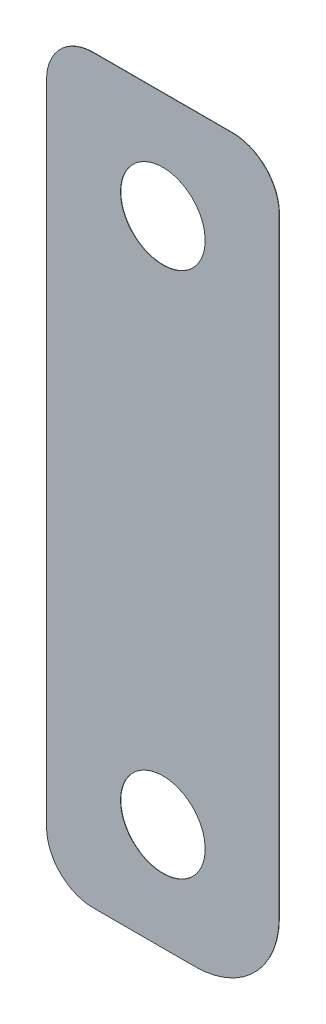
from build123d import *

# Parameters (mm, degrees)
BOSS_EXTRUDE1_DEPTH = 0.0254
HOLE1_D             = 7.1374


with BuildPart() as part:
    # Sketch2 → Boss-Extrude1 (new body)
    with BuildSketch(Plane(origin=(0, 0, 71.9328), x_dir=(-1, 0, 0), z_dir=(0, 0, -1))):
        with BuildLine():
            Line((925.956545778, 0.291593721), (914.209045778, 0.291593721))
            ThreePointArc((914.209045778, 0.291593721), (911.425166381, -0.861526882), (910.272045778, -3.645406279))
            Line((910.272045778, -3.645406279), (910.272045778, -55.080406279))
            ThreePointArc((910.272045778, -55.080406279), (912.355102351, -60.109349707), (917.384045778, -62.192406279))
            Line((917.384045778, -62.192406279), (925.956545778, -62.192406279))
            ThreePointArc((925.956545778, -62.192406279), (928.740425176, -61.039285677), (929.893545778, -58.255406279))
            Line((929.893545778, -58.255406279), (929.893545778, -3.645406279))
            ThreePointArc((929.893545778, -3.645406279), (928.740425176, -0.861526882), (925.956545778, 0.291593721))
        make_face()
    extrude(amount=-BOSS_EXTRUDE1_DEPTH)

    # Hole1 (through all)
    with Locations(Plane(origin=(-916.428535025, 1.875734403, 71.9328), x_dir=(-1, 0, 0), z_dir=(0, 0, -1))):
        with Locations((3.654260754, -10.601140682), (3.654260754, -55.051140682)):
            Hole(HOLE1_D / 2)


solid = part.part
